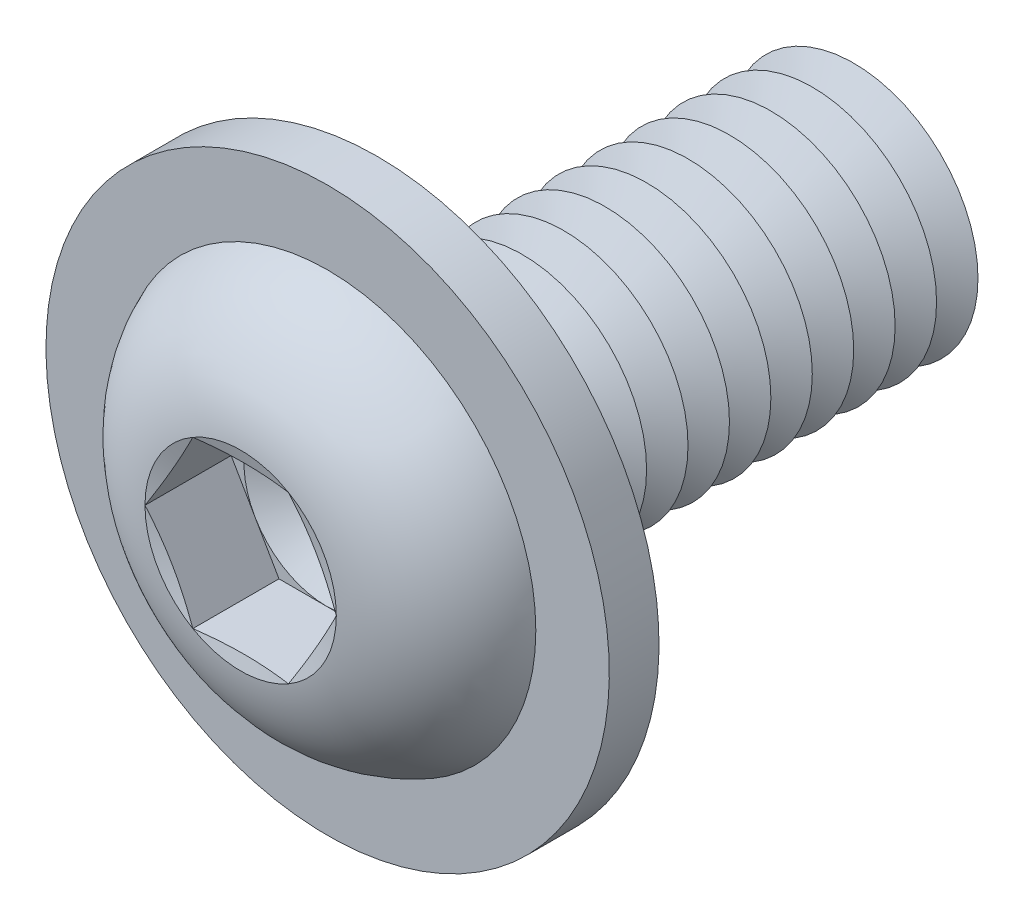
ISO-10303-21;
HEADER;
FILE_DESCRIPTION(('STEP AP214'),'2;1');
FILE_NAME('part.step','',(''),(''),'','','');
FILE_SCHEMA(('AUTOMOTIVE_DESIGN { 1 0 10303 214 1 1 1 1 }'));
ENDSEC;
DATA;
#1=APPLICATION_CONTEXT('core data for automotive mechanical design processes');
#2=APPLICATION_PROTOCOL_DEFINITION('international standard','automotive_design',2000,#1);
#3=PRODUCT_CONTEXT('',#1,'mechanical');
#4=PRODUCT('Part','Part','',(#3));
#5=PRODUCT_RELATED_PRODUCT_CATEGORY('part','',(#4));
#6=PRODUCT_DEFINITION_FORMATION('','',#4);
#7=PRODUCT_DEFINITION_CONTEXT('part definition',#1,'design');
#8=PRODUCT_DEFINITION('design','',#6,#7);
#9=PRODUCT_DEFINITION_SHAPE('','',#8);
#10=(LENGTH_UNIT() NAMED_UNIT(*) SI_UNIT(.MILLI.,.METRE.));
#11=(NAMED_UNIT(*) PLANE_ANGLE_UNIT() SI_UNIT($,.RADIAN.));
#12=(NAMED_UNIT(*) SI_UNIT($,.STERADIAN.) SOLID_ANGLE_UNIT());
#13=UNCERTAINTY_MEASURE_WITH_UNIT(LENGTH_MEASURE(1.E-05),#10,'distance_accuracy_value','');
#14=(GEOMETRIC_REPRESENTATION_CONTEXT(3) GLOBAL_UNCERTAINTY_ASSIGNED_CONTEXT((#13)) GLOBAL_UNIT_ASSIGNED_CONTEXT((#10,
#11,#12)) REPRESENTATION_CONTEXT('',''));
#15=CARTESIAN_POINT('',(0.,0.,0.));
#16=DIRECTION('',(0.,0.,1.));
#17=DIRECTION('',(1.,0.,0.));
#18=AXIS2_PLACEMENT_3D('',#15,#16,#17);
#19=CARTESIAN_POINT('',(0.,0.,-8.5));
#20=DIRECTION('',(0.,0.,1.));
#21=DIRECTION('',(1.,0.,0.));
#22=AXIS2_PLACEMENT_3D('',#19,#20,#21);
#23=CONICAL_SURFACE('',#22,3.,1.0471975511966);
#24=CARTESIAN_POINT('',(0.,0.,-9.));
#25=DIRECTION('',(0.,0.,1.));
#26=DIRECTION('',(1.,0.,0.));
#27=AXIS2_PLACEMENT_3D('',#24,#25,#26);
#28=CIRCLE('',#27,2.13397459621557);
#29=CARTESIAN_POINT('',(2.13397459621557,0.,-9.));
#30=VERTEX_POINT('',#29);
#31=EDGE_CURVE('E307',#30,#30,#28,.T.);
#32=ORIENTED_EDGE('',*,*,#31,.T.);
#33=EDGE_LOOP('',(#32));
#34=FACE_BOUND('',#33,.T.);
#35=CARTESIAN_POINT('',(0.,0.,-8.5));
#36=DIRECTION('',(0.,0.,1.));
#37=DIRECTION('',(1.,0.,0.));
#38=AXIS2_PLACEMENT_3D('',#35,#36,#37);
#39=CIRCLE('',#38,3.);
#40=CARTESIAN_POINT('',(3.,0.,-8.5));
#41=VERTEX_POINT('',#40);
#42=EDGE_CURVE('E303',#41,#41,#39,.T.);
#43=ORIENTED_EDGE('',*,*,#42,.F.);
#44=EDGE_LOOP('',(#43));
#45=FACE_BOUND('',#44,.T.);
#46=ADVANCED_FACE('F39',(#34,#45),#23,.T.);
#47=CARTESIAN_POINT('',(0.,0.,-9.));
#48=DIRECTION('',(0.,0.,-1.));
#49=DIRECTION('',(-1.,0.,0.));
#50=AXIS2_PLACEMENT_3D('',#47,#48,#49);
#51=CONICAL_SURFACE('',#50,2.13397459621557,1.0471975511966);
#52=CARTESIAN_POINT('',(0.,0.,-9.5));
#53=DIRECTION('',(0.,0.,1.));
#54=DIRECTION('',(1.,0.,0.));
#55=AXIS2_PLACEMENT_3D('',#52,#53,#54);
#56=CIRCLE('',#55,3.);
#57=CARTESIAN_POINT('',(3.,0.,-9.5));
#58=VERTEX_POINT('',#57);
#59=EDGE_CURVE('E311',#58,#58,#56,.T.);
#60=ORIENTED_EDGE('',*,*,#59,.T.);
#61=EDGE_LOOP('',(#60));
#62=FACE_BOUND('',#61,.T.);
#63=ORIENTED_EDGE('',*,*,#31,.F.);
#64=EDGE_LOOP('',(#63));
#65=FACE_BOUND('',#64,.T.);
#66=ADVANCED_FACE('F426',(#62,#65),#51,.T.);
#67=CARTESIAN_POINT('',(0.,3.00000000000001,-12.));
#68=DIRECTION('',(0.,0.,-1.));
#69=DIRECTION('',(-1.,0.,0.));
#70=AXIS2_PLACEMENT_3D('',#67,#68,#69);
#71=PLANE('',#70);
#72=CARTESIAN_POINT('',(0.,0.,-12.));
#73=DIRECTION('',(0.,0.,1.));
#74=DIRECTION('',(1.,0.,0.));
#75=AXIS2_PLACEMENT_3D('',#72,#73,#74);
#76=CIRCLE('',#75,2.13397459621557);
#77=CARTESIAN_POINT('',(2.13397459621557,0.,-12.));
#78=VERTEX_POINT('',#77);
#79=EDGE_CURVE('E331',#78,#78,#76,.T.);
#80=ORIENTED_EDGE('',*,*,#79,.F.);
#81=EDGE_LOOP('',(#80));
#82=FACE_BOUND('',#81,.T.);
#83=ADVANCED_FACE('F432',(#82),#71,.T.);
#84=CARTESIAN_POINT('',(0.,0.,-11.5));
#85=DIRECTION('',(0.,0.,1.));
#86=DIRECTION('',(1.,0.,0.));
#87=AXIS2_PLACEMENT_3D('',#84,#85,#86);
#88=CONICAL_SURFACE('',#87,3.,1.0471975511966);
#89=ORIENTED_EDGE('',*,*,#79,.T.);
#90=EDGE_LOOP('',(#89));
#91=FACE_BOUND('',#90,.T.);
#92=CARTESIAN_POINT('',(0.,0.,-11.5));
#93=DIRECTION('',(0.,0.,1.));
#94=DIRECTION('',(1.,0.,0.));
#95=AXIS2_PLACEMENT_3D('',#92,#93,#94);
#96=CIRCLE('',#95,3.);
#97=CARTESIAN_POINT('',(3.,0.,-11.5));
#98=VERTEX_POINT('',#97);
#99=EDGE_CURVE('E327',#98,#98,#96,.T.);
#100=ORIENTED_EDGE('',*,*,#99,.F.);
#101=EDGE_LOOP('',(#100));
#102=FACE_BOUND('',#101,.T.);
#103=ADVANCED_FACE('F451',(#91,#102),#88,.T.);
#104=CARTESIAN_POINT('',(0.,0.,-11.));
#105=DIRECTION('',(0.,0.,-1.));
#106=DIRECTION('',(-1.,0.,0.));
#107=AXIS2_PLACEMENT_3D('',#104,#105,#106);
#108=CONICAL_SURFACE('',#107,2.13397459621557,1.0471975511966);
#109=ORIENTED_EDGE('',*,*,#99,.T.);
#110=EDGE_LOOP('',(#109));
#111=FACE_BOUND('',#110,.T.);
#112=CARTESIAN_POINT('',(0.,0.,-11.));
#113=DIRECTION('',(0.,0.,1.));
#114=DIRECTION('',(1.,0.,0.));
#115=AXIS2_PLACEMENT_3D('',#112,#113,#114);
#116=CIRCLE('',#115,2.13397459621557);
#117=CARTESIAN_POINT('',(2.13397459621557,0.,-11.));
#118=VERTEX_POINT('',#117);
#119=EDGE_CURVE('E323',#118,#118,#116,.T.);
#120=ORIENTED_EDGE('',*,*,#119,.F.);
#121=EDGE_LOOP('',(#120));
#122=FACE_BOUND('',#121,.T.);
#123=ADVANCED_FACE('F448',(#111,#122),#108,.T.);
#124=CARTESIAN_POINT('',(0.,0.,-10.5));
#125=DIRECTION('',(0.,0.,1.));
#126=DIRECTION('',(1.,0.,0.));
#127=AXIS2_PLACEMENT_3D('',#124,#125,#126);
#128=CONICAL_SURFACE('',#127,3.,1.0471975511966);
#129=ORIENTED_EDGE('',*,*,#119,.T.);
#130=EDGE_LOOP('',(#129));
#131=FACE_BOUND('',#130,.T.);
#132=CARTESIAN_POINT('',(0.,0.,-10.5));
#133=DIRECTION('',(0.,0.,1.));
#134=DIRECTION('',(1.,0.,0.));
#135=AXIS2_PLACEMENT_3D('',#132,#133,#134);
#136=CIRCLE('',#135,3.);
#137=CARTESIAN_POINT('',(3.,0.,-10.5));
#138=VERTEX_POINT('',#137);
#139=EDGE_CURVE('E319',#138,#138,#136,.T.);
#140=ORIENTED_EDGE('',*,*,#139,.F.);
#141=EDGE_LOOP('',(#140));
#142=FACE_BOUND('',#141,.T.);
#143=ADVANCED_FACE('F442',(#131,#142),#128,.T.);
#144=CARTESIAN_POINT('',(0.,0.,-10.));
#145=DIRECTION('',(0.,0.,-1.));
#146=DIRECTION('',(-1.,0.,0.));
#147=AXIS2_PLACEMENT_3D('',#144,#145,#146);
#148=CONICAL_SURFACE('',#147,2.13397459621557,1.0471975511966);
#149=ORIENTED_EDGE('',*,*,#139,.T.);
#150=EDGE_LOOP('',(#149));
#151=FACE_BOUND('',#150,.T.);
#152=CARTESIAN_POINT('',(0.,0.,-10.));
#153=DIRECTION('',(0.,0.,1.));
#154=DIRECTION('',(1.,0.,0.));
#155=AXIS2_PLACEMENT_3D('',#152,#153,#154);
#156=CIRCLE('',#155,2.13397459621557);
#157=CARTESIAN_POINT('',(2.13397459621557,0.,-10.));
#158=VERTEX_POINT('',#157);
#159=EDGE_CURVE('E315',#158,#158,#156,.T.);
#160=ORIENTED_EDGE('',*,*,#159,.F.);
#161=EDGE_LOOP('',(#160));
#162=FACE_BOUND('',#161,.T.);
#163=ADVANCED_FACE('F438',(#151,#162),#148,.T.);
#164=CARTESIAN_POINT('',(0.,0.,-9.5));
#165=DIRECTION('',(0.,0.,1.));
#166=DIRECTION('',(1.,0.,0.));
#167=AXIS2_PLACEMENT_3D('',#164,#165,#166);
#168=CONICAL_SURFACE('',#167,3.,1.0471975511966);
#169=ORIENTED_EDGE('',*,*,#159,.T.);
#170=EDGE_LOOP('',(#169));
#171=FACE_BOUND('',#170,.T.);
#172=ORIENTED_EDGE('',*,*,#59,.F.);
#173=EDGE_LOOP('',(#172));
#174=FACE_BOUND('',#173,.T.);
#175=ADVANCED_FACE('F441',(#171,#174),#168,.T.);
#176=CARTESIAN_POINT('',(0.,0.,-7.5));
#177=DIRECTION('',(0.,0.,1.));
#178=DIRECTION('',(1.,0.,0.));
#179=AXIS2_PLACEMENT_3D('',#176,#177,#178);
#180=CONICAL_SURFACE('',#179,3.,1.0471975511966);
#181=CARTESIAN_POINT('',(0.,0.,-8.));
#182=DIRECTION('',(0.,0.,1.));
#183=DIRECTION('',(1.,0.,0.));
#184=AXIS2_PLACEMENT_3D('',#181,#182,#183);
#185=CIRCLE('',#184,2.13397459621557);
#186=CARTESIAN_POINT('',(2.13397459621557,0.,-8.));
#187=VERTEX_POINT('',#186);
#188=EDGE_CURVE('E299',#187,#187,#185,.T.);
#189=ORIENTED_EDGE('',*,*,#188,.T.);
#190=EDGE_LOOP('',(#189));
#191=FACE_BOUND('',#190,.T.);
#192=CARTESIAN_POINT('',(0.,0.,-7.5));
#193=DIRECTION('',(0.,0.,1.));
#194=DIRECTION('',(1.,0.,0.));
#195=AXIS2_PLACEMENT_3D('',#192,#193,#194);
#196=CIRCLE('',#195,3.);
#197=CARTESIAN_POINT('',(3.,0.,-7.5));
#198=VERTEX_POINT('',#197);
#199=EDGE_CURVE('E295',#198,#198,#196,.T.);
#200=ORIENTED_EDGE('',*,*,#199,.F.);
#201=EDGE_LOOP('',(#200));
#202=FACE_BOUND('',#201,.T.);
#203=ADVANCED_FACE('F446',(#191,#202),#180,.T.);
#204=CARTESIAN_POINT('',(0.,0.,-8.));
#205=DIRECTION('',(0.,0.,-1.));
#206=DIRECTION('',(-1.,0.,0.));
#207=AXIS2_PLACEMENT_3D('',#204,#205,#206);
#208=CONICAL_SURFACE('',#207,2.13397459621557,1.0471975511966);
#209=ORIENTED_EDGE('',*,*,#42,.T.);
#210=EDGE_LOOP('',(#209));
#211=FACE_BOUND('',#210,.T.);
#212=ORIENTED_EDGE('',*,*,#188,.F.);
#213=EDGE_LOOP('',(#212));
#214=FACE_BOUND('',#213,.T.);
#215=ADVANCED_FACE('F497',(#211,#214),#208,.T.);
#216=CARTESIAN_POINT('',(0.,0.,-6.5));
#217=DIRECTION('',(0.,0.,1.));
#218=DIRECTION('',(1.,0.,0.));
#219=AXIS2_PLACEMENT_3D('',#216,#217,#218);
#220=CONICAL_SURFACE('',#219,3.,1.0471975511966);
#221=CARTESIAN_POINT('',(0.,0.,-7.));
#222=DIRECTION('',(0.,0.,1.));
#223=DIRECTION('',(1.,0.,0.));
#224=AXIS2_PLACEMENT_3D('',#221,#222,#223);
#225=CIRCLE('',#224,2.13397459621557);
#226=CARTESIAN_POINT('',(2.13397459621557,0.,-7.));
#227=VERTEX_POINT('',#226);
#228=EDGE_CURVE('E291',#227,#227,#225,.T.);
#229=ORIENTED_EDGE('',*,*,#228,.T.);
#230=EDGE_LOOP('',(#229));
#231=FACE_BOUND('',#230,.T.);
#232=CARTESIAN_POINT('',(0.,0.,-6.5));
#233=DIRECTION('',(0.,0.,1.));
#234=DIRECTION('',(1.,0.,0.));
#235=AXIS2_PLACEMENT_3D('',#232,#233,#234);
#236=CIRCLE('',#235,3.);
#237=CARTESIAN_POINT('',(3.,0.,-6.5));
#238=VERTEX_POINT('',#237);
#239=EDGE_CURVE('E287',#238,#238,#236,.T.);
#240=ORIENTED_EDGE('',*,*,#239,.F.);
#241=EDGE_LOOP('',(#240));
#242=FACE_BOUND('',#241,.T.);
#243=ADVANCED_FACE('F503',(#231,#242),#220,.T.);
#244=CARTESIAN_POINT('',(0.,0.,-7.));
#245=DIRECTION('',(0.,0.,-1.));
#246=DIRECTION('',(-1.,0.,0.));
#247=AXIS2_PLACEMENT_3D('',#244,#245,#246);
#248=CONICAL_SURFACE('',#247,2.13397459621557,1.0471975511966);
#249=ORIENTED_EDGE('',*,*,#199,.T.);
#250=EDGE_LOOP('',(#249));
#251=FACE_BOUND('',#250,.T.);
#252=ORIENTED_EDGE('',*,*,#228,.F.);
#253=EDGE_LOOP('',(#252));
#254=FACE_BOUND('',#253,.T.);
#255=ADVANCED_FACE('F510',(#251,#254),#248,.T.);
#256=CARTESIAN_POINT('',(0.,0.,-5.5));
#257=DIRECTION('',(0.,0.,1.));
#258=DIRECTION('',(1.,0.,0.));
#259=AXIS2_PLACEMENT_3D('',#256,#257,#258);
#260=CONICAL_SURFACE('',#259,3.,1.0471975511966);
#261=CARTESIAN_POINT('',(0.,0.,-6.));
#262=DIRECTION('',(0.,0.,1.));
#263=DIRECTION('',(1.,0.,0.));
#264=AXIS2_PLACEMENT_3D('',#261,#262,#263);
#265=CIRCLE('',#264,2.13397459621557);
#266=CARTESIAN_POINT('',(2.13397459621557,0.,-6.));
#267=VERTEX_POINT('',#266);
#268=EDGE_CURVE('E283',#267,#267,#265,.T.);
#269=ORIENTED_EDGE('',*,*,#268,.T.);
#270=EDGE_LOOP('',(#269));
#271=FACE_BOUND('',#270,.T.);
#272=CARTESIAN_POINT('',(0.,0.,-5.5));
#273=DIRECTION('',(0.,0.,1.));
#274=DIRECTION('',(1.,0.,0.));
#275=AXIS2_PLACEMENT_3D('',#272,#273,#274);
#276=CIRCLE('',#275,3.);
#277=CARTESIAN_POINT('',(3.,0.,-5.5));
#278=VERTEX_POINT('',#277);
#279=EDGE_CURVE('E279',#278,#278,#276,.T.);
#280=ORIENTED_EDGE('',*,*,#279,.F.);
#281=EDGE_LOOP('',(#280));
#282=FACE_BOUND('',#281,.T.);
#283=ADVANCED_FACE('F517',(#271,#282),#260,.T.);
#284=CARTESIAN_POINT('',(0.,0.,-6.));
#285=DIRECTION('',(0.,0.,-1.));
#286=DIRECTION('',(-1.,0.,0.));
#287=AXIS2_PLACEMENT_3D('',#284,#285,#286);
#288=CONICAL_SURFACE('',#287,2.13397459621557,1.0471975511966);
#289=ORIENTED_EDGE('',*,*,#239,.T.);
#290=EDGE_LOOP('',(#289));
#291=FACE_BOUND('',#290,.T.);
#292=ORIENTED_EDGE('',*,*,#268,.F.);
#293=EDGE_LOOP('',(#292));
#294=FACE_BOUND('',#293,.T.);
#295=ADVANCED_FACE('F524',(#291,#294),#288,.T.);
#296=CARTESIAN_POINT('',(0.,0.,-4.5));
#297=DIRECTION('',(0.,0.,1.));
#298=DIRECTION('',(1.,0.,0.));
#299=AXIS2_PLACEMENT_3D('',#296,#297,#298);
#300=CONICAL_SURFACE('',#299,3.,1.0471975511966);
#301=CARTESIAN_POINT('',(0.,0.,-5.));
#302=DIRECTION('',(0.,0.,1.));
#303=DIRECTION('',(1.,0.,0.));
#304=AXIS2_PLACEMENT_3D('',#301,#302,#303);
#305=CIRCLE('',#304,2.13397459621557);
#306=CARTESIAN_POINT('',(2.13397459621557,0.,-5.));
#307=VERTEX_POINT('',#306);
#308=EDGE_CURVE('E275',#307,#307,#305,.T.);
#309=ORIENTED_EDGE('',*,*,#308,.T.);
#310=EDGE_LOOP('',(#309));
#311=FACE_BOUND('',#310,.T.);
#312=CARTESIAN_POINT('',(0.,0.,-4.5));
#313=DIRECTION('',(0.,0.,1.));
#314=DIRECTION('',(1.,0.,0.));
#315=AXIS2_PLACEMENT_3D('',#312,#313,#314);
#316=CIRCLE('',#315,3.);
#317=CARTESIAN_POINT('',(3.,0.,-4.5));
#318=VERTEX_POINT('',#317);
#319=EDGE_CURVE('E271',#318,#318,#316,.T.);
#320=ORIENTED_EDGE('',*,*,#319,.F.);
#321=EDGE_LOOP('',(#320));
#322=FACE_BOUND('',#321,.T.);
#323=ADVANCED_FACE('F531',(#311,#322),#300,.T.);
#324=CARTESIAN_POINT('',(0.,0.,-5.));
#325=DIRECTION('',(0.,0.,-1.));
#326=DIRECTION('',(-1.,0.,0.));
#327=AXIS2_PLACEMENT_3D('',#324,#325,#326);
#328=CONICAL_SURFACE('',#327,2.13397459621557,1.0471975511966);
#329=ORIENTED_EDGE('',*,*,#279,.T.);
#330=EDGE_LOOP('',(#329));
#331=FACE_BOUND('',#330,.T.);
#332=ORIENTED_EDGE('',*,*,#308,.F.);
#333=EDGE_LOOP('',(#332));
#334=FACE_BOUND('',#333,.T.);
#335=ADVANCED_FACE('F538',(#331,#334),#328,.T.);
#336=CARTESIAN_POINT('',(0.,0.,-3.5));
#337=DIRECTION('',(0.,0.,1.));
#338=DIRECTION('',(1.,0.,0.));
#339=AXIS2_PLACEMENT_3D('',#336,#337,#338);
#340=CONICAL_SURFACE('',#339,3.,1.0471975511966);
#341=CARTESIAN_POINT('',(0.,0.,-4.));
#342=DIRECTION('',(0.,0.,1.));
#343=DIRECTION('',(1.,0.,0.));
#344=AXIS2_PLACEMENT_3D('',#341,#342,#343);
#345=CIRCLE('',#344,2.13397459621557);
#346=CARTESIAN_POINT('',(2.13397459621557,0.,-4.));
#347=VERTEX_POINT('',#346);
#348=EDGE_CURVE('E267',#347,#347,#345,.T.);
#349=ORIENTED_EDGE('',*,*,#348,.T.);
#350=EDGE_LOOP('',(#349));
#351=FACE_BOUND('',#350,.T.);
#352=CARTESIAN_POINT('',(0.,0.,-3.5));
#353=DIRECTION('',(0.,0.,1.));
#354=DIRECTION('',(1.,0.,0.));
#355=AXIS2_PLACEMENT_3D('',#352,#353,#354);
#356=CIRCLE('',#355,3.);
#357=CARTESIAN_POINT('',(3.,0.,-3.5));
#358=VERTEX_POINT('',#357);
#359=EDGE_CURVE('E263',#358,#358,#356,.T.);
#360=ORIENTED_EDGE('',*,*,#359,.F.);
#361=EDGE_LOOP('',(#360));
#362=FACE_BOUND('',#361,.T.);
#363=ADVANCED_FACE('F545',(#351,#362),#340,.T.);
#364=CARTESIAN_POINT('',(0.,0.,-4.));
#365=DIRECTION('',(0.,0.,-1.));
#366=DIRECTION('',(-1.,0.,0.));
#367=AXIS2_PLACEMENT_3D('',#364,#365,#366);
#368=CONICAL_SURFACE('',#367,2.13397459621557,1.0471975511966);
#369=ORIENTED_EDGE('',*,*,#319,.T.);
#370=EDGE_LOOP('',(#369));
#371=FACE_BOUND('',#370,.T.);
#372=ORIENTED_EDGE('',*,*,#348,.F.);
#373=EDGE_LOOP('',(#372));
#374=FACE_BOUND('',#373,.T.);
#375=ADVANCED_FACE('F552',(#371,#374),#368,.T.);
#376=CARTESIAN_POINT('',(0.,0.,-2.5));
#377=DIRECTION('',(0.,0.,1.));
#378=DIRECTION('',(1.,0.,0.));
#379=AXIS2_PLACEMENT_3D('',#376,#377,#378);
#380=CONICAL_SURFACE('',#379,3.,1.0471975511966);
#381=CARTESIAN_POINT('',(0.,0.,-3.));
#382=DIRECTION('',(0.,0.,1.));
#383=DIRECTION('',(1.,0.,0.));
#384=AXIS2_PLACEMENT_3D('',#381,#382,#383);
#385=CIRCLE('',#384,2.13397459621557);
#386=CARTESIAN_POINT('',(2.13397459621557,0.,-3.));
#387=VERTEX_POINT('',#386);
#388=EDGE_CURVE('E259',#387,#387,#385,.T.);
#389=ORIENTED_EDGE('',*,*,#388,.T.);
#390=EDGE_LOOP('',(#389));
#391=FACE_BOUND('',#390,.T.);
#392=CARTESIAN_POINT('',(0.,0.,-2.5));
#393=DIRECTION('',(0.,0.,1.));
#394=DIRECTION('',(1.,0.,0.));
#395=AXIS2_PLACEMENT_3D('',#392,#393,#394);
#396=CIRCLE('',#395,3.);
#397=CARTESIAN_POINT('',(3.,0.,-2.5));
#398=VERTEX_POINT('',#397);
#399=EDGE_CURVE('E255',#398,#398,#396,.T.);
#400=ORIENTED_EDGE('',*,*,#399,.F.);
#401=EDGE_LOOP('',(#400));
#402=FACE_BOUND('',#401,.T.);
#403=ADVANCED_FACE('F559',(#391,#402),#380,.T.);
#404=CARTESIAN_POINT('',(0.,0.,-3.));
#405=DIRECTION('',(0.,0.,-1.));
#406=DIRECTION('',(-1.,0.,0.));
#407=AXIS2_PLACEMENT_3D('',#404,#405,#406);
#408=CONICAL_SURFACE('',#407,2.13397459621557,1.0471975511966);
#409=ORIENTED_EDGE('',*,*,#359,.T.);
#410=EDGE_LOOP('',(#409));
#411=FACE_BOUND('',#410,.T.);
#412=ORIENTED_EDGE('',*,*,#388,.F.);
#413=EDGE_LOOP('',(#412));
#414=FACE_BOUND('',#413,.T.);
#415=ADVANCED_FACE('F566',(#411,#414),#408,.T.);
#416=CARTESIAN_POINT('',(0.,0.,-1.5));
#417=DIRECTION('',(0.,0.,1.));
#418=DIRECTION('',(1.,0.,0.));
#419=AXIS2_PLACEMENT_3D('',#416,#417,#418);
#420=CONICAL_SURFACE('',#419,3.,1.0471975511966);
#421=CARTESIAN_POINT('',(0.,0.,-2.));
#422=DIRECTION('',(0.,0.,1.));
#423=DIRECTION('',(1.,0.,0.));
#424=AXIS2_PLACEMENT_3D('',#421,#422,#423);
#425=CIRCLE('',#424,2.13397459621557);
#426=CARTESIAN_POINT('',(2.13397459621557,0.,-2.));
#427=VERTEX_POINT('',#426);
#428=EDGE_CURVE('E251',#427,#427,#425,.T.);
#429=ORIENTED_EDGE('',*,*,#428,.T.);
#430=EDGE_LOOP('',(#429));
#431=FACE_BOUND('',#430,.T.);
#432=CARTESIAN_POINT('',(0.,0.,-1.5));
#433=DIRECTION('',(0.,0.,1.));
#434=DIRECTION('',(1.,0.,0.));
#435=AXIS2_PLACEMENT_3D('',#432,#433,#434);
#436=CIRCLE('',#435,3.);
#437=CARTESIAN_POINT('',(3.,0.,-1.5));
#438=VERTEX_POINT('',#437);
#439=EDGE_CURVE('E243',#438,#438,#436,.T.);
#440=ORIENTED_EDGE('',*,*,#439,.F.);
#441=EDGE_LOOP('',(#440));
#442=FACE_BOUND('',#441,.T.);
#443=ADVANCED_FACE('F573',(#431,#442),#420,.T.);
#444=CARTESIAN_POINT('',(0.,0.,-2.));
#445=DIRECTION('',(0.,0.,-1.));
#446=DIRECTION('',(-1.,0.,0.));
#447=AXIS2_PLACEMENT_3D('',#444,#445,#446);
#448=CONICAL_SURFACE('',#447,2.13397459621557,1.0471975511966);
#449=ORIENTED_EDGE('',*,*,#399,.T.);
#450=EDGE_LOOP('',(#449));
#451=FACE_BOUND('',#450,.T.);
#452=ORIENTED_EDGE('',*,*,#428,.F.);
#453=EDGE_LOOP('',(#452));
#454=FACE_BOUND('',#453,.T.);
#455=ADVANCED_FACE('F580',(#451,#454),#448,.T.);
#456=CARTESIAN_POINT('',(0.,0.,-0.5));
#457=DIRECTION('',(0.,0.,1.));
#458=DIRECTION('',(1.,0.,0.));
#459=AXIS2_PLACEMENT_3D('',#456,#457,#458);
#460=CONICAL_SURFACE('',#459,3.,1.0471975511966);
#461=CARTESIAN_POINT('',(0.,0.,-0.999999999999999));
#462=DIRECTION('',(0.,0.,1.));
#463=DIRECTION('',(1.,0.,0.));
#464=AXIS2_PLACEMENT_3D('',#461,#462,#463);
#465=CIRCLE('',#464,2.13397459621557);
#466=CARTESIAN_POINT('',(2.13397459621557,0.,-0.999999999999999));
#467=VERTEX_POINT('',#466);
#468=EDGE_CURVE('E232',#467,#467,#465,.T.);
#469=ORIENTED_EDGE('',*,*,#468,.T.);
#470=EDGE_LOOP('',(#469));
#471=FACE_BOUND('',#470,.T.);
#472=CARTESIAN_POINT('',(0.,0.,-0.5));
#473=DIRECTION('',(0.,0.,1.));
#474=DIRECTION('',(1.,0.,0.));
#475=AXIS2_PLACEMENT_3D('',#472,#473,#474);
#476=CIRCLE('',#475,3.);
#477=CARTESIAN_POINT('',(3.,0.,-0.5));
#478=VERTEX_POINT('',#477);
#479=EDGE_CURVE('E247',#478,#478,#476,.T.);
#480=ORIENTED_EDGE('',*,*,#479,.F.);
#481=EDGE_LOOP('',(#480));
#482=FACE_BOUND('',#481,.T.);
#483=ADVANCED_FACE('F587',(#471,#482),#460,.T.);
#484=CARTESIAN_POINT('',(0.,0.,-0.999999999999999));
#485=DIRECTION('',(0.,0.,-1.));
#486=DIRECTION('',(-1.,0.,0.));
#487=AXIS2_PLACEMENT_3D('',#484,#485,#486);
#488=CONICAL_SURFACE('',#487,2.13397459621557,1.0471975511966);
#489=ORIENTED_EDGE('',*,*,#439,.T.);
#490=EDGE_LOOP('',(#489));
#491=FACE_BOUND('',#490,.T.);
#492=ORIENTED_EDGE('',*,*,#468,.F.);
#493=EDGE_LOOP('',(#492));
#494=FACE_BOUND('',#493,.T.);
#495=ADVANCED_FACE('F221',(#491,#494),#488,.T.);
#496=CARTESIAN_POINT('',(0.,3.,0.));
#497=DIRECTION('',(0.,0.,-1.));
#498=DIRECTION('',(-1.,0.,0.));
#499=AXIS2_PLACEMENT_3D('',#496,#497,#498);
#500=PLANE('',#499);
#501=CARTESIAN_POINT('',(0.,0.,0.));
#502=DIRECTION('',(0.,0.,-1.));
#503=DIRECTION('',(-1.,0.,0.));
#504=AXIS2_PLACEMENT_3D('',#501,#502,#503);
#505=CIRCLE('',#504,3.5);
#506=CARTESIAN_POINT('',(-3.5,0.,0.));
#507=VERTEX_POINT('',#506);
#508=EDGE_CURVE('E339',#507,#507,#505,.F.);
#509=ORIENTED_EDGE('',*,*,#508,.T.);
#510=EDGE_LOOP('',(#509));
#511=FACE_BOUND('',#510,.T.);
#512=CARTESIAN_POINT('',(0.,0.,0.));
#513=DIRECTION('',(0.,0.,-1.));
#514=DIRECTION('',(0.,1.,0.));
#515=AXIS2_PLACEMENT_3D('',#512,#513,#514);
#516=CIRCLE('',#515,6.8);
#517=CARTESIAN_POINT('',(0.,6.8,0.));
#518=VERTEX_POINT('',#517);
#519=EDGE_CURVE('E403',#518,#518,#516,.T.);
#520=ORIENTED_EDGE('',*,*,#519,.T.);
#521=EDGE_LOOP('',(#520));
#522=FACE_BOUND('',#521,.T.);
#523=ADVANCED_FACE('F413',(#511,#522),#500,.T.);
#524=CARTESIAN_POINT('',(0.,0.,-0.5));
#525=DIRECTION('',(0.,0.,-1.));
#526=DIRECTION('',(-1.,0.,0.));
#527=AXIS2_PLACEMENT_3D('',#524,#525,#526);
#528=TOROIDAL_SURFACE('',#527,3.5,0.5);
#529=ORIENTED_EDGE('',*,*,#508,.F.);
#530=EDGE_LOOP('',(#529));
#531=FACE_BOUND('',#530,.T.);
#532=ORIENTED_EDGE('',*,*,#479,.T.);
#533=EDGE_LOOP('',(#532));
#534=FACE_BOUND('',#533,.T.);
#535=ADVANCED_FACE('F41',(#531,#534),#528,.F.);
#536=CARTESIAN_POINT('',(0.,0.,1.2));
#537=DIRECTION('',(0.,0.,-1.));
#538=DIRECTION('',(0.,1.,0.));
#539=AXIS2_PLACEMENT_3D('',#536,#537,#538);
#540=CYLINDRICAL_SURFACE('',#539,6.8);
#541=CARTESIAN_POINT('',(0.,0.,1.2));
#542=DIRECTION('',(0.,0.,-1.));
#543=DIRECTION('',(0.,1.,0.));
#544=AXIS2_PLACEMENT_3D('',#541,#542,#543);
#545=CIRCLE('',#544,6.8);
#546=CARTESIAN_POINT('',(0.,6.8,1.2));
#547=VERTEX_POINT('',#546);
#548=EDGE_CURVE('E399',#547,#547,#545,.T.);
#549=ORIENTED_EDGE('',*,*,#548,.T.);
#550=EDGE_LOOP('',(#549));
#551=FACE_BOUND('',#550,.T.);
#552=ORIENTED_EDGE('',*,*,#519,.F.);
#553=EDGE_LOOP('',(#552));
#554=FACE_BOUND('',#553,.T.);
#555=ADVANCED_FACE('F415',(#551,#554),#540,.T.);
#556=CARTESIAN_POINT('',(0.,0.,1.2));
#557=DIRECTION('',(0.,0.,-1.));
#558=DIRECTION('',(0.,1.,0.));
#559=AXIS2_PLACEMENT_3D('',#556,#557,#558);
#560=PLANE('',#559);
#561=CARTESIAN_POINT('',(0.,0.,1.2));
#562=DIRECTION('',(0.,0.,-1.));
#563=DIRECTION('',(0.,1.,0.));
#564=AXIS2_PLACEMENT_3D('',#561,#562,#563);
#565=CIRCLE('',#564,5.02568742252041);
#566=CARTESIAN_POINT('',(0.,5.02568742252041,1.2));
#567=VERTEX_POINT('',#566);
#568=EDGE_CURVE('E43',#567,#567,#565,.F.);
#569=ORIENTED_EDGE('',*,*,#568,.F.);
#570=EDGE_LOOP('',(#569));
#571=FACE_BOUND('',#570,.T.);
#572=ORIENTED_EDGE('',*,*,#548,.F.);
#573=EDGE_LOOP('',(#572));
#574=FACE_BOUND('',#573,.T.);
#575=ADVANCED_FACE('F117',(#571,#574),#560,.F.);
#576=CARTESIAN_POINT('',(0.,0.,1.22));
#577=DIRECTION('',(0.,0.,1.));
#578=DIRECTION('',(1.,0.,0.));
#579=AXIS2_PLACEMENT_3D('',#576,#577,#578);
#580=CONICAL_SURFACE('',#579,1.99999906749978,1.0471975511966);
#581=CARTESIAN_POINT('',(0.,0.,0.0653000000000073));
#582=VERTEX_POINT('',#581);
#583=VERTEX_LOOP('',#582);
#584=FACE_BOUND('',#583,.T.);
#585=CARTESIAN_POINT('',(0.,0.,1.22));
#586=DIRECTION('',(0.,0.,1.));
#587=DIRECTION('',(1.,0.,0.));
#588=AXIS2_PLACEMENT_3D('',#585,#586,#587);
#589=CIRCLE('',#588,1.99999906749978);
#590=CARTESIAN_POINT('',(1.73205,0.999999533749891,1.22));
#591=VERTEX_POINT('',#590);
#592=CARTESIAN_POINT('',(0.,1.99999906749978,1.22));
#593=VERTEX_POINT('',#592);
#594=EDGE_CURVE('E120',#591,#593,#589,.T.);
#595=ORIENTED_EDGE('',*,*,#594,.T.);
#596=CARTESIAN_POINT('',(0.,0.,1.22));
#597=DIRECTION('',(0.,0.,1.));
#598=DIRECTION('',(1.,0.,0.));
#599=AXIS2_PLACEMENT_3D('',#596,#597,#598);
#600=CIRCLE('',#599,1.99999906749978);
#601=CARTESIAN_POINT('',(-1.73205,0.999999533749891,1.22));
#602=VERTEX_POINT('',#601);
#603=EDGE_CURVE('E11',#593,#602,#600,.T.);
#604=ORIENTED_EDGE('',*,*,#603,.T.);
#605=CARTESIAN_POINT('',(-1.73205,-0.999999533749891,1.22));
#606=VERTEX_POINT('',#605);
#607=EDGE_CURVE('E49',#602,#606,#600,.T.);
#608=ORIENTED_EDGE('',*,*,#607,.T.);
#609=CARTESIAN_POINT('',(0.,-1.99999906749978,1.22));
#610=VERTEX_POINT('',#609);
#611=EDGE_CURVE('E345',#606,#610,#600,.T.);
#612=ORIENTED_EDGE('',*,*,#611,.T.);
#613=CARTESIAN_POINT('',(1.73205,-0.999999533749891,1.22));
#614=VERTEX_POINT('',#613);
#615=EDGE_CURVE('E57',#610,#614,#600,.T.);
#616=ORIENTED_EDGE('',*,*,#615,.T.);
#617=EDGE_CURVE('E50',#614,#591,#600,.T.);
#618=ORIENTED_EDGE('',*,*,#617,.T.);
#619=EDGE_LOOP('',(#595,#604,#608,#612,#616,#618));
#620=FACE_BOUND('',#619,.T.);
#621=ADVANCED_FACE('F114',(#584,#620),#580,.F.);
#622=CARTESIAN_POINT('',(0.,0.,1.22));
#623=DIRECTION('',(0.,0.,1.));
#624=DIRECTION('',(1.,0.,0.));
#625=AXIS2_PLACEMENT_3D('',#622,#623,#624);
#626=PLANE('',#625);
#627=ORIENTED_EDGE('',*,*,#611,.F.);
#628=DIRECTION('',(0.5,-0.866025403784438,0.));
#629=VECTOR('',#628,1.);
#630=CARTESIAN_POINT('',(-2.3094,0.,1.22));
#631=LINE('',#630,#629);
#632=CARTESIAN_POINT('',(-1.1547,-1.99999906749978,1.22));
#633=VERTEX_POINT('',#632);
#634=EDGE_CURVE('E154',#606,#633,#631,.T.);
#635=ORIENTED_EDGE('',*,*,#634,.T.);
#636=DIRECTION('',(1.,0.,0.));
#637=VECTOR('',#636,1.);
#638=CARTESIAN_POINT('',(-1.1547,-1.99999906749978,1.22));
#639=LINE('',#638,#637);
#640=EDGE_CURVE('E160',#633,#610,#639,.T.);
#641=ORIENTED_EDGE('',*,*,#640,.T.);
#642=EDGE_LOOP('',(#627,#635,#641));
#643=FACE_BOUND('',#642,.T.);
#644=ADVANCED_FACE('F116',(#643),#626,.T.);
#645=ORIENTED_EDGE('',*,*,#615,.F.);
#646=CARTESIAN_POINT('',(1.1547,-1.99999906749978,1.22));
#647=VERTEX_POINT('',#646);
#648=EDGE_CURVE('E159',#610,#647,#639,.T.);
#649=ORIENTED_EDGE('',*,*,#648,.T.);
#650=DIRECTION('',(0.5,0.866025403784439,0.));
#651=VECTOR('',#650,1.);
#652=CARTESIAN_POINT('',(1.1547,-1.99999906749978,1.22));
#653=LINE('',#652,#651);
#654=EDGE_CURVE('E165',#647,#614,#653,.T.);
#655=ORIENTED_EDGE('',*,*,#654,.T.);
#656=EDGE_LOOP('',(#645,#649,#655));
#657=FACE_BOUND('',#656,.T.);
#658=ADVANCED_FACE('F629',(#657),#626,.T.);
#659=ORIENTED_EDGE('',*,*,#617,.F.);
#660=CARTESIAN_POINT('',(2.3094,0.,1.22));
#661=VERTEX_POINT('',#660);
#662=EDGE_CURVE('E164',#614,#661,#653,.T.);
#663=ORIENTED_EDGE('',*,*,#662,.T.);
#664=DIRECTION('',(-0.5,0.866025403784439,0.));
#665=VECTOR('',#664,1.);
#666=CARTESIAN_POINT('',(2.3094,0.,1.22));
#667=LINE('',#666,#665);
#668=EDGE_CURVE('E142',#661,#591,#667,.T.);
#669=ORIENTED_EDGE('',*,*,#668,.T.);
#670=EDGE_LOOP('',(#659,#663,#669));
#671=FACE_BOUND('',#670,.T.);
#672=ADVANCED_FACE('F638',(#671),#626,.T.);
#673=ORIENTED_EDGE('',*,*,#594,.F.);
#674=CARTESIAN_POINT('',(1.1547,1.99999906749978,1.22));
#675=VERTEX_POINT('',#674);
#676=EDGE_CURVE('E127',#591,#675,#667,.T.);
#677=ORIENTED_EDGE('',*,*,#676,.T.);
#678=DIRECTION('',(-1.,0.,0.));
#679=VECTOR('',#678,1.);
#680=CARTESIAN_POINT('',(1.1547,1.99999906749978,1.22));
#681=LINE('',#680,#679);
#682=EDGE_CURVE('E138',#675,#593,#681,.T.);
#683=ORIENTED_EDGE('',*,*,#682,.T.);
#684=EDGE_LOOP('',(#673,#677,#683));
#685=FACE_BOUND('',#684,.T.);
#686=ADVANCED_FACE('F144',(#685),#626,.T.);
#687=ORIENTED_EDGE('',*,*,#603,.F.);
#688=CARTESIAN_POINT('',(-1.1547,1.99999906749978,1.22));
#689=VERTEX_POINT('',#688);
#690=EDGE_CURVE('E133',#593,#689,#681,.T.);
#691=ORIENTED_EDGE('',*,*,#690,.T.);
#692=DIRECTION('',(-0.5,-0.866025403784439,0.));
#693=VECTOR('',#692,1.);
#694=CARTESIAN_POINT('',(-1.1547,1.99999906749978,1.22));
#695=LINE('',#694,#693);
#696=EDGE_CURVE('E136',#689,#602,#695,.T.);
#697=ORIENTED_EDGE('',*,*,#696,.T.);
#698=EDGE_LOOP('',(#687,#691,#697));
#699=FACE_BOUND('',#698,.T.);
#700=ADVANCED_FACE('F132',(#699),#626,.T.);
#701=ORIENTED_EDGE('',*,*,#607,.F.);
#702=CARTESIAN_POINT('',(-2.3094,0.,1.22));
#703=VERTEX_POINT('',#702);
#704=EDGE_CURVE('E146',#602,#703,#695,.T.);
#705=ORIENTED_EDGE('',*,*,#704,.T.);
#706=EDGE_CURVE('E155',#703,#606,#631,.T.);
#707=ORIENTED_EDGE('',*,*,#706,.T.);
#708=EDGE_LOOP('',(#701,#705,#707));
#709=FACE_BOUND('',#708,.T.);
#710=ADVANCED_FACE('F358',(#709),#626,.T.);
#711=CARTESIAN_POINT('',(-2.3094,0.,1.22));
#712=DIRECTION('',(-0.866025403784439,-0.5,0.));
#713=DIRECTION('',(0.5,-0.866025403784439,0.));
#714=AXIS2_PLACEMENT_3D('',#711,#712,#713);
#715=PLANE('',#714);
#716=CARTESIAN_POINT('',(-2.30951547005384,0.000200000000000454,3.30003094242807));
#717=CARTESIAN_POINT('',(-2.26155412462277,-0.082871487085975,3.2871729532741));
#718=CARTESIAN_POINT('',(-2.21350580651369,-0.166093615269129,3.27549992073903));
#719=CARTESIAN_POINT('',(-2.11723944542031,-0.332831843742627,3.2549913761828));
#720=CARTESIAN_POINT('',(-2.06902134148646,-0.416348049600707,3.24615701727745));
#721=CARTESIAN_POINT('',(-1.97270782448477,-0.583167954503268,3.23184167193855));
#722=CARTESIAN_POINT('',(-1.92461306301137,-0.666470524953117,3.22634360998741));
#723=CARTESIAN_POINT('',(-1.82836219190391,-0.83318192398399,3.21897125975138));
#724=CARTESIAN_POINT('',(-1.78020609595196,-0.916590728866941,3.21709626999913));
#725=CARTESIAN_POINT('',(-1.68389390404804,-1.08340833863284,3.21709626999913));
#726=CARTESIAN_POINT('',(-1.63573780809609,-1.16681714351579,3.21897125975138));
#727=CARTESIAN_POINT('',(-1.53948693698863,-1.33352854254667,3.22634360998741));
#728=CARTESIAN_POINT('',(-1.49139217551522,-1.41683111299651,3.23184167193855));
#729=CARTESIAN_POINT('',(-1.39507865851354,-1.58365101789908,3.24615701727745));
#730=CARTESIAN_POINT('',(-1.34686055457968,-1.66716722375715,3.2549913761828));
#731=CARTESIAN_POINT('',(-1.25059419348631,-1.83390545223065,3.27549992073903));
#732=CARTESIAN_POINT('',(-1.20254587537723,-1.91712758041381,3.2871729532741));
#733=CARTESIAN_POINT('',(-1.15458452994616,-2.00019906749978,3.30003094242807));
#734=B_SPLINE_CURVE_WITH_KNOTS('',3,(#716,#717,#718,#719,#720,#721,#722,#723,#724,#725,#726,
#727,#728,#729,#730,#731,#732,#733),.UNSPECIFIED.,.F.,.F.,(4,2,2,2,2,2,2,2,4),(0.,
0.290357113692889,0.580832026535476,0.869807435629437,1.15872689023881,1.44764634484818,
1.73662175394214,2.02709666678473,2.31745378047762),.UNSPECIFIED.);
#735=CARTESIAN_POINT('',(-2.3094,0.,3.3));
#736=VERTEX_POINT('',#735);
#737=CARTESIAN_POINT('',(-1.1547,-1.99999906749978,3.3));
#738=VERTEX_POINT('',#737);
#739=EDGE_CURVE('E363',#736,#738,#734,.T.);
#740=ORIENTED_EDGE('',*,*,#739,.T.);
#741=DIRECTION('',(0.,0.,1.));
#742=VECTOR('',#741,1.);
#743=CARTESIAN_POINT('',(-1.1547,-1.99999906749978,1.22));
#744=LINE('',#743,#742);
#745=EDGE_CURVE('E178',#633,#738,#744,.T.);
#746=ORIENTED_EDGE('',*,*,#745,.F.);
#747=ORIENTED_EDGE('',*,*,#634,.F.);
#748=ORIENTED_EDGE('',*,*,#706,.F.);
#749=DIRECTION('',(0.,0.,1.));
#750=VECTOR('',#749,1.);
#751=CARTESIAN_POINT('',(-2.3094,0.,1.22));
#752=LINE('',#751,#750);
#753=EDGE_CURVE('E182',#703,#736,#752,.T.);
#754=ORIENTED_EDGE('',*,*,#753,.T.);
#755=EDGE_LOOP('',(#740,#746,#747,#748,#754));
#756=FACE_BOUND('',#755,.T.);
#757=ADVANCED_FACE('F356',(#756),#715,.F.);
#758=CARTESIAN_POINT('',(-1.1547,-1.99999906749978,1.22));
#759=DIRECTION('',(0.,-1.,0.));
#760=DIRECTION('',(0.,0.,-1.));
#761=AXIS2_PLACEMENT_3D('',#758,#759,#760);
#762=PLANE('',#761);
#763=CARTESIAN_POINT('',(-3.4849337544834,-1.99999906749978,3.75783251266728));
#764=CARTESIAN_POINT('',(-3.40057136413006,-1.99999906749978,3.7382285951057));
#765=CARTESIAN_POINT('',(-3.31617090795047,-1.99999906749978,3.71878852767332));
#766=CARTESIAN_POINT('',(-3.14727791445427,-1.99999906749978,3.68030638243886));
#767=CARTESIAN_POINT('',(-3.06278537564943,-1.99999906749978,3.6612643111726));
#768=CARTESIAN_POINT('',(-2.80911712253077,-1.99999906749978,3.604834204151));
#769=CARTESIAN_POINT('',(-2.63978343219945,-1.99999906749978,3.5681499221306));
#770=CARTESIAN_POINT('',(-2.29895421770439,-1.99999906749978,3.49717072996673));
#771=CARTESIAN_POINT('',(-2.12745330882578,-1.99999906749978,3.4629014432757));
#772=CARTESIAN_POINT('',(-1.78364663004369,-1.99999906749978,3.39849485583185));
#773=CARTESIAN_POINT('',(-1.61134079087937,-1.99999906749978,3.36835791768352));
#774=CARTESIAN_POINT('',(-1.27040784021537,-1.99999906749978,3.31501553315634));
#775=CARTESIAN_POINT('',(-1.10180724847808,-1.99999906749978,3.29164468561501));
#776=CARTESIAN_POINT('',(-0.76364137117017,-1.99999906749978,3.2533727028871));
#777=CARTESIAN_POINT('',(-0.594076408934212,-1.99999906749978,3.23846888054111));
#778=CARTESIAN_POINT('',(-0.339649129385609,-1.99999906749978,3.22431372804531));
#779=CARTESIAN_POINT('',(-0.255009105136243,-1.99999906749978,3.22096057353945));
#780=CARTESIAN_POINT('',(-0.0856618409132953,-1.99999906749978,3.21711210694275));
#781=CARTESIAN_POINT('',(-0.000954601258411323,-1.99999906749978,3.21661678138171));
#782=CARTESIAN_POINT('',(0.168430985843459,-1.99999906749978,3.21851478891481));
#783=CARTESIAN_POINT('',(0.253109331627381,-1.99999906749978,3.22090826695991));
#784=CARTESIAN_POINT('',(0.422344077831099,-1.99999906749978,3.22845792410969));
#785=CARTESIAN_POINT('',(0.506900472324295,-1.99999906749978,3.23361423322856));
#786=CARTESIAN_POINT('',(0.712240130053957,-1.99999906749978,3.24921577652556));
#787=CARTESIAN_POINT('',(0.832922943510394,-1.99999906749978,3.26098285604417));
#788=CARTESIAN_POINT('',(1.07378161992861,-1.99999906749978,3.28874908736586));
#789=CARTESIAN_POINT('',(1.1939575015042,-1.99999906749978,3.30474808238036));
#790=CARTESIAN_POINT('',(1.43419655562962,-1.99999906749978,3.34009172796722));
#791=CARTESIAN_POINT('',(1.55425817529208,-1.99999906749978,3.35944677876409));
#792=CARTESIAN_POINT('',(1.79394991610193,-1.99999906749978,3.40067076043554));
#793=CARTESIAN_POINT('',(1.91358001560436,-1.99999906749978,3.42253981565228));
#794=CARTESIAN_POINT('',(2.15493405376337,-1.99999906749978,3.46864194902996));
#795=CARTESIAN_POINT('',(2.27665041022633,-1.99999906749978,3.49291441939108));
#796=CARTESIAN_POINT('',(2.51977680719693,-1.99999906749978,3.54294628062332));
#797=CARTESIAN_POINT('',(2.64118684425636,-1.99999906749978,3.56870568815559));
#798=CARTESIAN_POINT('',(2.88310060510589,-1.99999906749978,3.6212089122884));
#799=CARTESIAN_POINT('',(3.00360566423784,-1.99999906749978,3.64794660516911));
#800=CARTESIAN_POINT('',(3.24441021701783,-1.99999906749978,3.70229477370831));
#801=CARTESIAN_POINT('',(3.36470972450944,-1.99999906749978,3.7299051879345));
#802=CARTESIAN_POINT('',(3.4849337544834,-1.99999906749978,3.75783251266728));
#803=B_SPLINE_CURVE_WITH_KNOTS('',3,(#763,#764,#765,#766,#767,#768,#769,#770,#771,#772,#773,
#774,#775,#776,#777,#778,#779,#780,#781,#782,#783,#784,#785,#786,#787,#788,#789,#790,#791,#792,
#793,#794,#795,#796,#797,#798,#799,#800,#801,#802),.UNSPECIFIED.,.F.,.F.,(4,2,2,2,2,2,2,2,2,2,2,
2,2,2,2,2,2,2,2,4),(0.,0.259830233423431,0.519664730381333,1.03943435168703,1.56407662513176,
2.08876490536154,2.59926476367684,3.10960251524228,3.36367930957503,3.61775490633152,
3.87184325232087,4.1259435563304,4.48960924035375,4.85326145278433,5.21806142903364,
5.58287945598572,5.95520617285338,6.32753706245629,6.69784064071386,7.06811821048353),.UNSPECIFIED.);
#804=CARTESIAN_POINT('',(1.1547,-1.99999906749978,3.3));
#805=VERTEX_POINT('',#804);
#806=EDGE_CURVE('E370',#738,#805,#803,.T.);
#807=ORIENTED_EDGE('',*,*,#806,.T.);
#808=DIRECTION('',(0.,0.,1.));
#809=VECTOR('',#808,1.);
#810=CARTESIAN_POINT('',(1.1547,-1.99999906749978,1.22));
#811=LINE('',#810,#809);
#812=EDGE_CURVE('E174',#647,#805,#811,.T.);
#813=ORIENTED_EDGE('',*,*,#812,.F.);
#814=ORIENTED_EDGE('',*,*,#648,.F.);
#815=ORIENTED_EDGE('',*,*,#640,.F.);
#816=ORIENTED_EDGE('',*,*,#745,.T.);
#817=EDGE_LOOP('',(#807,#813,#814,#815,#816));
#818=FACE_BOUND('',#817,.T.);
#819=ADVANCED_FACE('F672',(#818),#762,.F.);
#820=CARTESIAN_POINT('',(1.1547,-1.99999906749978,1.22));
#821=DIRECTION('',(0.866025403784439,-0.5,0.));
#822=DIRECTION('',(0.5,0.866025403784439,0.));
#823=AXIS2_PLACEMENT_3D('',#820,#821,#822);
#824=PLANE('',#823);
#825=CARTESIAN_POINT('',(1.15458452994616,-2.00019906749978,3.30003094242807));
#826=CARTESIAN_POINT('',(1.20254587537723,-1.91712758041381,3.2871729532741));
#827=CARTESIAN_POINT('',(1.25059419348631,-1.83390545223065,3.27549992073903));
#828=CARTESIAN_POINT('',(1.34686055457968,-1.66716722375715,3.2549913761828));
#829=CARTESIAN_POINT('',(1.39507865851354,-1.58365101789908,3.24615701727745));
#830=CARTESIAN_POINT('',(1.49139217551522,-1.41683111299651,3.23184167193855));
#831=CARTESIAN_POINT('',(1.53948693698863,-1.33352854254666,3.22634360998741));
#832=CARTESIAN_POINT('',(1.63573780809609,-1.16681714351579,3.21897125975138));
#833=CARTESIAN_POINT('',(1.68389390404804,-1.08340833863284,3.21709626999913));
#834=CARTESIAN_POINT('',(1.78020609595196,-0.91659072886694,3.21709626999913));
#835=CARTESIAN_POINT('',(1.82836219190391,-0.83318192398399,3.21897125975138));
#836=CARTESIAN_POINT('',(1.92461306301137,-0.666470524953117,3.22634360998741));
#837=CARTESIAN_POINT('',(1.97270782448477,-0.583167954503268,3.23184167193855));
#838=CARTESIAN_POINT('',(2.06902134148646,-0.416348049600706,3.24615701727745));
#839=CARTESIAN_POINT('',(2.11723944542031,-0.332831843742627,3.2549913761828));
#840=CARTESIAN_POINT('',(2.21350580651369,-0.166093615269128,3.27549992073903));
#841=CARTESIAN_POINT('',(2.26155412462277,-0.0828714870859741,3.2871729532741));
#842=CARTESIAN_POINT('',(2.30951547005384,0.000200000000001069,3.30003094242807));
#843=B_SPLINE_CURVE_WITH_KNOTS('',3,(#825,#826,#827,#828,#829,#830,#831,#832,#833,#834,#835,
#836,#837,#838,#839,#840,#841,#842),.UNSPECIFIED.,.F.,.F.,(4,2,2,2,2,2,2,2,4),(0.,
0.290357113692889,0.580832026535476,0.869807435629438,1.15872689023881,1.44764634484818,
1.73662175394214,2.02709666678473,2.31745378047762),.UNSPECIFIED.);
#844=CARTESIAN_POINT('',(2.3094,0.,3.3));
#845=VERTEX_POINT('',#844);
#846=EDGE_CURVE('E233',#805,#845,#843,.T.);
#847=ORIENTED_EDGE('',*,*,#846,.T.);
#848=DIRECTION('',(0.,0.,1.));
#849=VECTOR('',#848,1.);
#850=CARTESIAN_POINT('',(2.3094,0.,1.22));
#851=LINE('',#850,#849);
#852=EDGE_CURVE('E169',#661,#845,#851,.T.);
#853=ORIENTED_EDGE('',*,*,#852,.F.);
#854=ORIENTED_EDGE('',*,*,#662,.F.);
#855=ORIENTED_EDGE('',*,*,#654,.F.);
#856=ORIENTED_EDGE('',*,*,#812,.T.);
#857=EDGE_LOOP('',(#847,#853,#854,#855,#856));
#858=FACE_BOUND('',#857,.T.);
#859=ADVANCED_FACE('F219',(#858),#824,.F.);
#860=CARTESIAN_POINT('',(2.3094,0.,1.22));
#861=DIRECTION('',(0.866025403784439,0.5,0.));
#862=DIRECTION('',(-0.5,0.866025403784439,0.));
#863=AXIS2_PLACEMENT_3D('',#860,#861,#862);
#864=PLANE('',#863);
#865=CARTESIAN_POINT('',(2.30951547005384,-0.000199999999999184,3.30003094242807));
#866=CARTESIAN_POINT('',(2.26155412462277,0.082871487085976,3.2871729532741));
#867=CARTESIAN_POINT('',(2.21350580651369,0.16609361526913,3.27549992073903));
#868=CARTESIAN_POINT('',(2.11723944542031,0.332831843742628,3.2549913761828));
#869=CARTESIAN_POINT('',(2.06902134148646,0.416348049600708,3.24615701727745));
#870=CARTESIAN_POINT('',(1.97270782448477,0.583167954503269,3.23184167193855));
#871=CARTESIAN_POINT('',(1.92461306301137,0.666470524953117,3.22634360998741));
#872=CARTESIAN_POINT('',(1.82836219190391,0.833181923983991,3.21897125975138));
#873=CARTESIAN_POINT('',(1.78020609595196,0.916590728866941,3.21709626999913));
#874=CARTESIAN_POINT('',(1.68389390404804,1.08340833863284,3.21709626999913));
#875=CARTESIAN_POINT('',(1.63573780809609,1.16681714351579,3.21897125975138));
#876=CARTESIAN_POINT('',(1.53948693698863,1.33352854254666,3.22634360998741));
#877=CARTESIAN_POINT('',(1.49139217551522,1.41683111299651,3.23184167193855));
#878=CARTESIAN_POINT('',(1.39507865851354,1.58365101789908,3.24615701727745));
#879=CARTESIAN_POINT('',(1.34686055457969,1.66716722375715,3.2549913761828));
#880=CARTESIAN_POINT('',(1.25059419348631,1.83390545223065,3.27549992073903));
#881=CARTESIAN_POINT('',(1.20254587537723,1.91712758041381,3.2871729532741));
#882=CARTESIAN_POINT('',(1.15458452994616,2.00019906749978,3.30003094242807));
#883=B_SPLINE_CURVE_WITH_KNOTS('',3,(#865,#866,#867,#868,#869,#870,#871,#872,#873,#874,#875,
#876,#877,#878,#879,#880,#881,#882),.UNSPECIFIED.,.F.,.F.,(4,2,2,2,2,2,2,2,4),(0.,
0.290357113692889,0.580832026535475,0.869807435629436,1.15872689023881,1.44764634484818,
1.73662175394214,2.02709666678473,2.31745378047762),.UNSPECIFIED.);
#884=CARTESIAN_POINT('',(1.1547,1.99999906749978,3.3));
#885=VERTEX_POINT('',#884);
#886=EDGE_CURVE('E224',#845,#885,#883,.T.);
#887=ORIENTED_EDGE('',*,*,#886,.T.);
#888=DIRECTION('',(0.,0.,1.));
#889=VECTOR('',#888,1.);
#890=CARTESIAN_POINT('',(1.1547,1.99999906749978,1.22));
#891=LINE('',#890,#889);
#892=EDGE_CURVE('E65',#675,#885,#891,.T.);
#893=ORIENTED_EDGE('',*,*,#892,.F.);
#894=ORIENTED_EDGE('',*,*,#676,.F.);
#895=ORIENTED_EDGE('',*,*,#668,.F.);
#896=ORIENTED_EDGE('',*,*,#852,.T.);
#897=EDGE_LOOP('',(#887,#893,#894,#895,#896));
#898=FACE_BOUND('',#897,.T.);
#899=ADVANCED_FACE('F213',(#898),#864,.F.);
#900=CARTESIAN_POINT('',(1.1547,1.99999906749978,1.22));
#901=DIRECTION('',(0.,1.,0.));
#902=DIRECTION('',(-1.,0.,0.));
#903=AXIS2_PLACEMENT_3D('',#900,#901,#902);
#904=PLANE('',#903);
#905=CARTESIAN_POINT('',(3.4849337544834,1.99999906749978,3.75783251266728));
#906=CARTESIAN_POINT('',(3.40057136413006,1.99999906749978,3.7382285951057));
#907=CARTESIAN_POINT('',(3.31617090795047,1.99999906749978,3.71878852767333));
#908=CARTESIAN_POINT('',(3.14727791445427,1.99999906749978,3.68030638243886));
#909=CARTESIAN_POINT('',(3.06278537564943,1.99999906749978,3.6612643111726));
#910=CARTESIAN_POINT('',(2.80911712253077,1.99999906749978,3.604834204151));
#911=CARTESIAN_POINT('',(2.63978343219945,1.99999906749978,3.5681499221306));
#912=CARTESIAN_POINT('',(2.29895421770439,1.99999906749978,3.49717072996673));
#913=CARTESIAN_POINT('',(2.12745330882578,1.99999906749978,3.4629014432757));
#914=CARTESIAN_POINT('',(1.78364663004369,1.99999906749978,3.39849485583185));
#915=CARTESIAN_POINT('',(1.61134079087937,1.99999906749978,3.36835791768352));
#916=CARTESIAN_POINT('',(1.27040784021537,1.99999906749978,3.31501553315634));
#917=CARTESIAN_POINT('',(1.10180724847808,1.99999906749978,3.29164468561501));
#918=CARTESIAN_POINT('',(0.763641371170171,1.99999906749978,3.2533727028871));
#919=CARTESIAN_POINT('',(0.594076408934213,1.99999906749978,3.23846888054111));
#920=CARTESIAN_POINT('',(0.339649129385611,1.99999906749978,3.22431372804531));
#921=CARTESIAN_POINT('',(0.255009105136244,1.99999906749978,3.22096057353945));
#922=CARTESIAN_POINT('',(0.0856618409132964,1.99999906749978,3.21711210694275));
#923=CARTESIAN_POINT('',(0.000954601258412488,1.99999906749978,3.21661678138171));
#924=CARTESIAN_POINT('',(-0.168430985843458,1.99999906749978,3.21851478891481));
#925=CARTESIAN_POINT('',(-0.25310933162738,1.99999906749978,3.22090826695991));
#926=CARTESIAN_POINT('',(-0.422344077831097,1.99999906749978,3.22845792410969));
#927=CARTESIAN_POINT('',(-0.506900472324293,1.99999906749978,3.23361423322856));
#928=CARTESIAN_POINT('',(-0.712240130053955,1.99999906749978,3.24921577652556));
#929=CARTESIAN_POINT('',(-0.832922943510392,1.99999906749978,3.26098285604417));
#930=CARTESIAN_POINT('',(-1.07378161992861,1.99999906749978,3.28874908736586));
#931=CARTESIAN_POINT('',(-1.1939575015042,1.99999906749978,3.30474808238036));
#932=CARTESIAN_POINT('',(-1.43419655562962,1.99999906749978,3.34009172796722));
#933=CARTESIAN_POINT('',(-1.55425817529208,1.99999906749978,3.35944677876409));
#934=CARTESIAN_POINT('',(-1.79394991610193,1.99999906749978,3.40067076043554));
#935=CARTESIAN_POINT('',(-1.91358001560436,1.99999906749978,3.42253981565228));
#936=CARTESIAN_POINT('',(-2.15493405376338,1.99999906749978,3.46864194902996));
#937=CARTESIAN_POINT('',(-2.27665041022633,1.99999906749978,3.49291441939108));
#938=CARTESIAN_POINT('',(-2.51977680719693,1.99999906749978,3.54294628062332));
#939=CARTESIAN_POINT('',(-2.64118684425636,1.99999906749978,3.56870568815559));
#940=CARTESIAN_POINT('',(-2.8831006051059,1.99999906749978,3.6212089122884));
#941=CARTESIAN_POINT('',(-3.00360566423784,1.99999906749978,3.64794660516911));
#942=CARTESIAN_POINT('',(-3.24441021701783,1.99999906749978,3.70229477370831));
#943=CARTESIAN_POINT('',(-3.36470972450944,1.99999906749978,3.7299051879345));
#944=CARTESIAN_POINT('',(-3.4849337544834,1.99999906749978,3.75783251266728));
#945=B_SPLINE_CURVE_WITH_KNOTS('',3,(#905,#906,#907,#908,#909,#910,#911,#912,#913,#914,#915,
#916,#917,#918,#919,#920,#921,#922,#923,#924,#925,#926,#927,#928,#929,#930,#931,#932,#933,#934,
#935,#936,#937,#938,#939,#940,#941,#942,#943,#944),.UNSPECIFIED.,.F.,.F.,(4,2,2,2,2,2,2,2,2,2,2,
2,2,2,2,2,2,2,2,4),(0.,0.259830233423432,0.519664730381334,1.03943435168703,1.56407662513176,
2.08876490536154,2.59926476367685,3.10960251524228,3.36367930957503,3.61775490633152,
3.87184325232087,4.1259435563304,4.48960924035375,4.85326145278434,5.21806142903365,
5.58287945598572,5.95520617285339,6.3275370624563,6.69784064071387,7.06811821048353),.UNSPECIFIED.);
#946=CARTESIAN_POINT('',(-1.1547,1.99999906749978,3.3));
#947=VERTEX_POINT('',#946);
#948=EDGE_CURVE('E173',#885,#947,#945,.T.);
#949=ORIENTED_EDGE('',*,*,#948,.T.);
#950=DIRECTION('',(0.,0.,1.));
#951=VECTOR('',#950,1.);
#952=CARTESIAN_POINT('',(-1.1547,1.99999906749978,1.22));
#953=LINE('',#952,#951);
#954=EDGE_CURVE('E140',#689,#947,#953,.T.);
#955=ORIENTED_EDGE('',*,*,#954,.F.);
#956=ORIENTED_EDGE('',*,*,#690,.F.);
#957=ORIENTED_EDGE('',*,*,#682,.F.);
#958=ORIENTED_EDGE('',*,*,#892,.T.);
#959=EDGE_LOOP('',(#949,#955,#956,#957,#958));
#960=FACE_BOUND('',#959,.T.);
#961=ADVANCED_FACE('F137',(#960),#904,.F.);
#962=CARTESIAN_POINT('',(-1.1547,1.99999906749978,1.22));
#963=DIRECTION('',(-0.866025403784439,0.5,0.));
#964=DIRECTION('',(-0.5,-0.866025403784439,0.));
#965=AXIS2_PLACEMENT_3D('',#962,#963,#964);
#966=PLANE('',#965);
#967=CARTESIAN_POINT('',(-1.15458452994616,2.00019906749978,3.30003094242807));
#968=CARTESIAN_POINT('',(-1.20254587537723,1.91712758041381,3.2871729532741));
#969=CARTESIAN_POINT('',(-1.25059419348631,1.83390545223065,3.27549992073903));
#970=CARTESIAN_POINT('',(-1.34686055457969,1.66716722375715,3.2549913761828));
#971=CARTESIAN_POINT('',(-1.39507865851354,1.58365101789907,3.24615701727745));
#972=CARTESIAN_POINT('',(-1.49139217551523,1.41683111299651,3.23184167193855));
#973=CARTESIAN_POINT('',(-1.53948693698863,1.33352854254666,3.22634360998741));
#974=CARTESIAN_POINT('',(-1.63573780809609,1.16681714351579,3.21897125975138));
#975=CARTESIAN_POINT('',(-1.68389390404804,1.08340833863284,3.21709626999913));
#976=CARTESIAN_POINT('',(-1.78020609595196,0.916590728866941,3.21709626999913));
#977=CARTESIAN_POINT('',(-1.82836219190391,0.83318192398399,3.21897125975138));
#978=CARTESIAN_POINT('',(-1.92461306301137,0.666470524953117,3.22634360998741));
#979=CARTESIAN_POINT('',(-1.97270782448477,0.583167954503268,3.23184167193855));
#980=CARTESIAN_POINT('',(-2.06902134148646,0.416348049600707,3.24615701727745));
#981=CARTESIAN_POINT('',(-2.11723944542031,0.332831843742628,3.2549913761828));
#982=CARTESIAN_POINT('',(-2.21350580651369,0.16609361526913,3.27549992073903));
#983=CARTESIAN_POINT('',(-2.26155412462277,0.0828714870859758,3.2871729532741));
#984=CARTESIAN_POINT('',(-2.30951547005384,-0.000199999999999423,3.30003094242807));
#985=B_SPLINE_CURVE_WITH_KNOTS('',3,(#967,#968,#969,#970,#971,#972,#973,#974,#975,#976,#977,
#978,#979,#980,#981,#982,#983,#984),.UNSPECIFIED.,.F.,.F.,(4,2,2,2,2,2,2,2,4),(0.,
0.290357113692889,0.580832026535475,0.869807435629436,1.15872689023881,1.44764634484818,
1.73662175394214,2.02709666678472,2.31745378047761),.UNSPECIFIED.);
#986=EDGE_CURVE('E198',#947,#736,#985,.T.);
#987=ORIENTED_EDGE('',*,*,#986,.T.);
#988=ORIENTED_EDGE('',*,*,#753,.F.);
#989=ORIENTED_EDGE('',*,*,#704,.F.);
#990=ORIENTED_EDGE('',*,*,#696,.F.);
#991=ORIENTED_EDGE('',*,*,#954,.T.);
#992=EDGE_LOOP('',(#987,#988,#989,#990,#991));
#993=FACE_BOUND('',#992,.T.);
#994=ADVANCED_FACE('F212',(#993),#966,.F.);
#995=CARTESIAN_POINT('',(0.,0.,3.3));
#996=DIRECTION('',(0.,0.,1.));
#997=DIRECTION('',(1.,0.,0.));
#998=AXIS2_PLACEMENT_3D('',#995,#996,#997);
#999=CONICAL_SURFACE('',#998,2.3094,1.30899693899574);
#1000=ORIENTED_EDGE('',*,*,#739,.F.);
#1001=CARTESIAN_POINT('',(0.,0.,3.3));
#1002=DIRECTION('',(0.,0.,-1.));
#1003=DIRECTION('',(-1.,0.,0.));
#1004=AXIS2_PLACEMENT_3D('',#1001,#1002,#1003);
#1005=CIRCLE('',#1004,2.3094);
#1006=EDGE_CURVE('E334',#738,#736,#1005,.T.);
#1007=ORIENTED_EDGE('',*,*,#1006,.F.);
#1008=EDGE_LOOP('',(#1000,#1007));
#1009=FACE_BOUND('',#1008,.T.);
#1010=ADVANCED_FACE('F367',(#1009),#999,.F.);
#1011=ORIENTED_EDGE('',*,*,#806,.F.);
#1012=EDGE_CURVE('E378',#805,#738,#1005,.T.);
#1013=ORIENTED_EDGE('',*,*,#1012,.F.);
#1014=EDGE_LOOP('',(#1011,#1013));
#1015=FACE_BOUND('',#1014,.T.);
#1016=ADVANCED_FACE('F708',(#1015),#999,.F.);
#1017=ORIENTED_EDGE('',*,*,#846,.F.);
#1018=EDGE_CURVE('E391',#845,#805,#1005,.T.);
#1019=ORIENTED_EDGE('',*,*,#1018,.F.);
#1020=EDGE_LOOP('',(#1017,#1019));
#1021=FACE_BOUND('',#1020,.T.);
#1022=ADVANCED_FACE('F716',(#1021),#999,.F.);
#1023=ORIENTED_EDGE('',*,*,#886,.F.);
#1024=EDGE_CURVE('E389',#885,#845,#1005,.T.);
#1025=ORIENTED_EDGE('',*,*,#1024,.F.);
#1026=EDGE_LOOP('',(#1023,#1025));
#1027=FACE_BOUND('',#1026,.T.);
#1028=ADVANCED_FACE('F724',(#1027),#999,.F.);
#1029=ORIENTED_EDGE('',*,*,#948,.F.);
#1030=EDGE_CURVE('E340',#947,#885,#1005,.T.);
#1031=ORIENTED_EDGE('',*,*,#1030,.F.);
#1032=EDGE_LOOP('',(#1029,#1031));
#1033=FACE_BOUND('',#1032,.T.);
#1034=ADVANCED_FACE('F205',(#1033),#999,.F.);
#1035=ORIENTED_EDGE('',*,*,#986,.F.);
#1036=EDGE_CURVE('E335',#736,#947,#1005,.T.);
#1037=ORIENTED_EDGE('',*,*,#1036,.F.);
#1038=EDGE_LOOP('',(#1035,#1037));
#1039=FACE_BOUND('',#1038,.T.);
#1040=ADVANCED_FACE('F381',(#1039),#999,.F.);
#1041=CARTESIAN_POINT('',(0.,0.,0.));
#1042=DIRECTION('',(0.,0.,-1.));
#1043=DIRECTION('',(-1.,0.,0.));
#1044=AXIS2_PLACEMENT_3D('',#1041,#1042,#1043);
#1045=DEGENERATE_TOROIDAL_SURFACE('',#1044,1.92803707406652,3.32196292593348,.T.);
#1046=ORIENTED_EDGE('',*,*,#1036,.T.);
#1047=ORIENTED_EDGE('',*,*,#1030,.T.);
#1048=ORIENTED_EDGE('',*,*,#1024,.T.);
#1049=ORIENTED_EDGE('',*,*,#1018,.T.);
#1050=ORIENTED_EDGE('',*,*,#1012,.T.);
#1051=ORIENTED_EDGE('',*,*,#1006,.T.);
#1052=EDGE_LOOP('',(#1046,#1047,#1048,#1049,#1050,#1051));
#1053=FACE_BOUND('',#1052,.T.);
#1054=ORIENTED_EDGE('',*,*,#568,.T.);
#1055=EDGE_LOOP('',(#1054));
#1056=FACE_BOUND('',#1055,.T.);
#1057=ADVANCED_FACE('F373',(#1053,#1056),#1045,.T.);
#1058=CLOSED_SHELL('',(#46,#66,#83,#103,#123,#143,#163,#175,#203,#215,#243,#255,#283,#295,#323,
#335,#363,#375,#403,#415,#443,#455,#483,#495,#523,#535,#555,#575,#621,#644,#658,#672,#686,#700,
#710,#757,#819,#859,#899,#961,#994,#1010,#1016,#1022,#1028,#1034,#1040,#1057));
#1059=MANIFOLD_SOLID_BREP('B2',#1058);
#1060=ADVANCED_BREP_SHAPE_REPRESENTATION('',(#18,#1059),#14);
#1061=SHAPE_DEFINITION_REPRESENTATION(#9,#1060);
ENDSEC;
END-ISO-10303-21;
